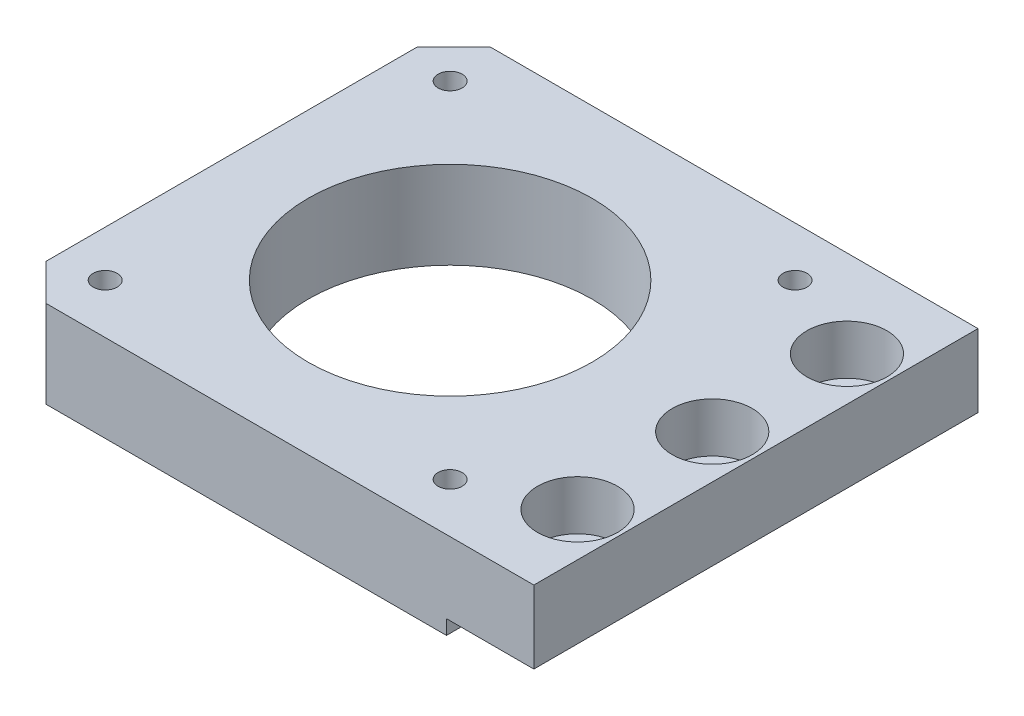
ISO-10303-21;
HEADER;
FILE_DESCRIPTION(('STEP AP214'),'2;1');
FILE_NAME('part.step','',(''),(''),'','','');
FILE_SCHEMA(('AUTOMOTIVE_DESIGN { 1 0 10303 214 1 1 1 1 }'));
ENDSEC;
DATA;
#1=APPLICATION_CONTEXT('core data for automotive mechanical design processes');
#2=APPLICATION_PROTOCOL_DEFINITION('international standard','automotive_design',2000,#1);
#3=PRODUCT_CONTEXT('',#1,'mechanical');
#4=PRODUCT('Part','Part','',(#3));
#5=PRODUCT_RELATED_PRODUCT_CATEGORY('part','',(#4));
#6=PRODUCT_DEFINITION_FORMATION('','',#4);
#7=PRODUCT_DEFINITION_CONTEXT('part definition',#1,'design');
#8=PRODUCT_DEFINITION('design','',#6,#7);
#9=PRODUCT_DEFINITION_SHAPE('','',#8);
#10=(LENGTH_UNIT() NAMED_UNIT(*) SI_UNIT(.MILLI.,.METRE.));
#11=(NAMED_UNIT(*) PLANE_ANGLE_UNIT() SI_UNIT($,.RADIAN.));
#12=(NAMED_UNIT(*) SI_UNIT($,.STERADIAN.) SOLID_ANGLE_UNIT());
#13=UNCERTAINTY_MEASURE_WITH_UNIT(LENGTH_MEASURE(1.E-05),#10,'distance_accuracy_value','');
#14=(GEOMETRIC_REPRESENTATION_CONTEXT(3) GLOBAL_UNCERTAINTY_ASSIGNED_CONTEXT((#13)) GLOBAL_UNIT_ASSIGNED_CONTEXT((#10,
#11,#12)) REPRESENTATION_CONTEXT('',''));
#15=CARTESIAN_POINT('',(0.,0.,0.));
#16=DIRECTION('',(0.,0.,1.));
#17=DIRECTION('',(1.,0.,0.));
#18=AXIS2_PLACEMENT_3D('',#15,#16,#17);
#19=CARTESIAN_POINT('',(-0.519371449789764,58.3620375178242,-61.));
#20=DIRECTION('',(0.,1.,0.));
#21=DIRECTION('',(-1.,0.,0.));
#22=AXIS2_PLACEMENT_3D('',#19,#20,#21);
#23=PLANE('',#22);
#24=CARTESIAN_POINT('',(-66.2074486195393,58.3620375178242,-6.81192283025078));
#25=DIRECTION('',(0.,-1.,0.));
#26=DIRECTION('',(0.,0.,-1.));
#27=AXIS2_PLACEMENT_3D('',#24,#25,#26);
#28=CIRCLE('',#27,1.65);
#29=CARTESIAN_POINT('',(-66.2074486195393,58.3620375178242,-8.46192283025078));
#30=VERTEX_POINT('',#29);
#31=EDGE_CURVE('E328',#30,#30,#28,.T.);
#32=ORIENTED_EDGE('',*,*,#31,.T.);
#33=EDGE_LOOP('',(#32));
#34=FACE_BOUND('',#33,.T.);
#35=CARTESIAN_POINT('',(-66.2074486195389,58.3620375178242,-54.1880771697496));
#36=DIRECTION('',(0.,-1.,0.));
#37=DIRECTION('',(0.,0.,-1.));
#38=AXIS2_PLACEMENT_3D('',#35,#36,#37);
#39=CIRCLE('',#38,1.65);
#40=CARTESIAN_POINT('',(-66.2074486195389,58.3620375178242,-55.8380771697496));
#41=VERTEX_POINT('',#40);
#42=EDGE_CURVE('E333',#41,#41,#39,.T.);
#43=ORIENTED_EDGE('',*,*,#42,.T.);
#44=EDGE_LOOP('',(#43));
#45=FACE_BOUND('',#44,.T.);
#46=CARTESIAN_POINT('',(-6.51937144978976,58.3620375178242,-49.));
#47=DIRECTION('',(0.,1.,0.));
#48=DIRECTION('',(0.,0.,1.));
#49=AXIS2_PLACEMENT_3D('',#46,#47,#48);
#50=CIRCLE('',#49,5.5);
#51=CARTESIAN_POINT('',(-6.51937144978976,58.3620375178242,-43.5));
#52=VERTEX_POINT('',#51);
#53=EDGE_CURVE('E336',#52,#52,#50,.T.);
#54=ORIENTED_EDGE('',*,*,#53,.F.);
#55=EDGE_LOOP('',(#54));
#56=FACE_BOUND('',#55,.T.);
#57=CARTESIAN_POINT('',(-6.51937144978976,58.3620375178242,-30.5));
#58=DIRECTION('',(0.,1.,0.));
#59=DIRECTION('',(0.,0.,1.));
#60=AXIS2_PLACEMENT_3D('',#57,#58,#59);
#61=CIRCLE('',#60,5.5);
#62=CARTESIAN_POINT('',(-6.51937144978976,58.3620375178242,-25.));
#63=VERTEX_POINT('',#62);
#64=EDGE_CURVE('E170',#63,#63,#61,.T.);
#65=ORIENTED_EDGE('',*,*,#64,.F.);
#66=EDGE_LOOP('',(#65));
#67=FACE_BOUND('',#66,.T.);
#68=CARTESIAN_POINT('',(-6.51937144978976,58.3620375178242,-12.));
#69=DIRECTION('',(0.,1.,0.));
#70=DIRECTION('',(0.,0.,1.));
#71=AXIS2_PLACEMENT_3D('',#68,#69,#70);
#72=CIRCLE('',#71,5.5);
#73=CARTESIAN_POINT('',(-6.51937144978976,58.3620375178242,-6.5));
#74=VERTEX_POINT('',#73);
#75=EDGE_CURVE('E157',#74,#74,#72,.T.);
#76=ORIENTED_EDGE('',*,*,#75,.F.);
#77=EDGE_LOOP('',(#76));
#78=FACE_BOUND('',#77,.T.);
#79=CARTESIAN_POINT('',(-42.5193714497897,58.3620375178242,-30.5));
#80=DIRECTION('',(0.,-1.,0.));
#81=DIRECTION('',(1.,0.,0.));
#82=AXIS2_PLACEMENT_3D('',#79,#80,#81);
#83=CIRCLE('',#82,19.5);
#84=CARTESIAN_POINT('',(-23.0193714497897,58.3620375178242,-30.5));
#85=VERTEX_POINT('',#84);
#86=EDGE_CURVE('E120',#85,#85,#83,.T.);
#87=ORIENTED_EDGE('',*,*,#86,.T.);
#88=EDGE_LOOP('',(#87));
#89=FACE_BOUND('',#88,.T.);
#90=DIRECTION('',(0.,0.,1.));
#91=VECTOR('',#90,1.);
#92=CARTESIAN_POINT('',(-72.5193714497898,58.3620375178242,-61.));
#93=LINE('',#92,#91);
#94=CARTESIAN_POINT('',(-72.5193714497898,58.3620375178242,-56.));
#95=VERTEX_POINT('',#94);
#96=CARTESIAN_POINT('',(-72.5193714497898,58.3620375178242,-5.));
#97=VERTEX_POINT('',#96);
#98=EDGE_CURVE('E130',#95,#97,#93,.T.);
#99=ORIENTED_EDGE('',*,*,#98,.T.);
#100=DIRECTION('',(-0.707106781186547,0.,-0.707106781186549));
#101=VECTOR('',#100,1.);
#102=CARTESIAN_POINT('',(-64.5193714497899,58.3620375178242,2.9999999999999));
#103=LINE('',#102,#101);
#104=CARTESIAN_POINT('',(-67.5193714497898,58.3620375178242,0.));
#105=VERTEX_POINT('',#104);
#106=EDGE_CURVE('E25',#97,#105,#103,.F.);
#107=ORIENTED_EDGE('',*,*,#106,.T.);
#108=DIRECTION('',(-1.,0.,0.));
#109=VECTOR('',#108,1.);
#110=CARTESIAN_POINT('',(-0.519371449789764,58.3620375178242,0.));
#111=LINE('',#110,#109);
#112=CARTESIAN_POINT('',(-0.519371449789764,58.3620375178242,0.));
#113=VERTEX_POINT('',#112);
#114=EDGE_CURVE('E94',#113,#105,#111,.T.);
#115=ORIENTED_EDGE('',*,*,#114,.F.);
#116=DIRECTION('',(0.,0.,1.));
#117=VECTOR('',#116,1.);
#118=CARTESIAN_POINT('',(-0.519371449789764,58.3620375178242,-61.));
#119=LINE('',#118,#117);
#120=CARTESIAN_POINT('',(-0.519371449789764,58.3620375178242,-61.));
#121=VERTEX_POINT('',#120);
#122=EDGE_CURVE('E133',#121,#113,#119,.T.);
#123=ORIENTED_EDGE('',*,*,#122,.F.);
#124=DIRECTION('',(-1.,0.,0.));
#125=VECTOR('',#124,1.);
#126=CARTESIAN_POINT('',(-0.519371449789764,58.3620375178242,-61.));
#127=LINE('',#126,#125);
#128=CARTESIAN_POINT('',(-67.5193714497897,58.3620375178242,-61.));
#129=VERTEX_POINT('',#128);
#130=EDGE_CURVE('E116',#121,#129,#127,.T.);
#131=ORIENTED_EDGE('',*,*,#130,.T.);
#132=DIRECTION('',(-0.707106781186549,0.,0.707106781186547));
#133=VECTOR('',#132,1.);
#134=CARTESIAN_POINT('',(-34.0193714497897,58.3620375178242,-94.5));
#135=LINE('',#134,#133);
#136=EDGE_CURVE('E148',#129,#95,#135,.T.);
#137=ORIENTED_EDGE('',*,*,#136,.T.);
#138=EDGE_LOOP('',(#99,#107,#115,#123,#131,#137));
#139=FACE_BOUND('',#138,.T.);
#140=CARTESIAN_POINT('',(-18.8312942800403,58.3620375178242,-54.1880771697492));
#141=DIRECTION('',(0.,-1.,0.));
#142=DIRECTION('',(0.,0.,-1.));
#143=AXIS2_PLACEMENT_3D('',#140,#141,#142);
#144=CIRCLE('',#143,1.65);
#145=CARTESIAN_POINT('',(-18.8312942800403,58.3620375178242,-55.8380771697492));
#146=VERTEX_POINT('',#145);
#147=EDGE_CURVE('E322',#146,#146,#144,.T.);
#148=ORIENTED_EDGE('',*,*,#147,.T.);
#149=EDGE_LOOP('',(#148));
#150=FACE_BOUND('',#149,.T.);
#151=CARTESIAN_POINT('',(-18.8312942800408,58.3620375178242,-6.8119228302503));
#152=DIRECTION('',(0.,-1.,0.));
#153=DIRECTION('',(0.,0.,-1.));
#154=AXIS2_PLACEMENT_3D('',#151,#152,#153);
#155=CIRCLE('',#154,1.65);
#156=CARTESIAN_POINT('',(-18.8312942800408,58.3620375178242,-8.4619228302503));
#157=VERTEX_POINT('',#156);
#158=EDGE_CURVE('E313',#157,#157,#155,.T.);
#159=ORIENTED_EDGE('',*,*,#158,.T.);
#160=EDGE_LOOP('',(#159));
#161=FACE_BOUND('',#160,.T.);
#162=ADVANCED_FACE('F16',(#34,#45,#56,#67,#78,#89,#139,#150,#161),#23,.T.);
#163=CARTESIAN_POINT('',(-72.5193714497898,46.3620375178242,-61.));
#164=DIRECTION('',(-1.,0.,0.));
#165=DIRECTION('',(0.,0.,1.));
#166=AXIS2_PLACEMENT_3D('',#163,#164,#165);
#167=PLANE('',#166);
#168=DIRECTION('',(0.,0.,1.));
#169=VECTOR('',#168,1.);
#170=CARTESIAN_POINT('',(-72.5193714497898,46.3620375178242,-61.));
#171=LINE('',#170,#169);
#172=CARTESIAN_POINT('',(-72.5193714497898,46.3620375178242,-56.));
#173=VERTEX_POINT('',#172);
#174=CARTESIAN_POINT('',(-72.5193714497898,46.3620375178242,-5.));
#175=VERTEX_POINT('',#174);
#176=EDGE_CURVE('E102',#173,#175,#171,.T.);
#177=ORIENTED_EDGE('',*,*,#176,.T.);
#178=DIRECTION('',(0.,1.,0.));
#179=VECTOR('',#178,1.);
#180=CARTESIAN_POINT('',(-72.5193714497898,46.3620375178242,-5.));
#181=LINE('',#180,#179);
#182=EDGE_CURVE('E39',#175,#97,#181,.T.);
#183=ORIENTED_EDGE('',*,*,#182,.T.);
#184=ORIENTED_EDGE('',*,*,#98,.F.);
#185=DIRECTION('',(0.,-1.,0.));
#186=VECTOR('',#185,1.);
#187=CARTESIAN_POINT('',(-72.5193714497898,46.3620375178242,-56.));
#188=LINE('',#187,#186);
#189=EDGE_CURVE('E144',#95,#173,#188,.T.);
#190=ORIENTED_EDGE('',*,*,#189,.T.);
#191=EDGE_LOOP('',(#177,#183,#184,#190));
#192=FACE_BOUND('',#191,.T.);
#193=ADVANCED_FACE('F201',(#192),#167,.T.);
#194=CARTESIAN_POINT('',(-0.519371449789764,48.3620375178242,-61.));
#195=DIRECTION('',(1.,0.,0.));
#196=DIRECTION('',(0.,0.,-1.));
#197=AXIS2_PLACEMENT_3D('',#194,#195,#196);
#198=PLANE('',#197);
#199=DIRECTION('',(0.,1.,0.));
#200=VECTOR('',#199,1.);
#201=CARTESIAN_POINT('',(-0.519371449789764,48.3620375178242,0.));
#202=LINE('',#201,#200);
#203=CARTESIAN_POINT('',(-0.519371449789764,48.3620375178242,0.));
#204=VERTEX_POINT('',#203);
#205=EDGE_CURVE('E125',#204,#113,#202,.T.);
#206=ORIENTED_EDGE('',*,*,#205,.F.);
#207=DIRECTION('',(0.,0.,1.));
#208=VECTOR('',#207,1.);
#209=CARTESIAN_POINT('',(-0.519371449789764,48.3620375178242,-61.));
#210=LINE('',#209,#208);
#211=CARTESIAN_POINT('',(-0.519371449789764,48.3620375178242,-61.));
#212=VERTEX_POINT('',#211);
#213=EDGE_CURVE('E135',#212,#204,#210,.T.);
#214=ORIENTED_EDGE('',*,*,#213,.F.);
#215=DIRECTION('',(0.,1.,0.));
#216=VECTOR('',#215,1.);
#217=CARTESIAN_POINT('',(-0.519371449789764,48.3620375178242,-61.));
#218=LINE('',#217,#216);
#219=EDGE_CURVE('E110',#212,#121,#218,.T.);
#220=ORIENTED_EDGE('',*,*,#219,.T.);
#221=ORIENTED_EDGE('',*,*,#122,.T.);
#222=EDGE_LOOP('',(#206,#214,#220,#221));
#223=FACE_BOUND('',#222,.T.);
#224=ADVANCED_FACE('F208',(#223),#198,.T.);
#225=CARTESIAN_POINT('',(-0.519371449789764,48.3620375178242,-61.));
#226=DIRECTION('',(0.,-1.,0.));
#227=DIRECTION('',(0.,0.,-1.));
#228=AXIS2_PLACEMENT_3D('',#225,#226,#227);
#229=PLANE('',#228);
#230=CARTESIAN_POINT('',(-6.51937144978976,48.3620375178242,-49.));
#231=DIRECTION('',(0.,-1.,0.));
#232=DIRECTION('',(0.,0.,-1.));
#233=AXIS2_PLACEMENT_3D('',#230,#231,#232);
#234=CIRCLE('',#233,3.3);
#235=CARTESIAN_POINT('',(-6.51937144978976,48.3620375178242,-52.3));
#236=VERTEX_POINT('',#235);
#237=EDGE_CURVE('E20',#236,#236,#234,.T.);
#238=ORIENTED_EDGE('',*,*,#237,.F.);
#239=EDGE_LOOP('',(#238));
#240=FACE_BOUND('',#239,.T.);
#241=CARTESIAN_POINT('',(-6.51937144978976,48.3620375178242,-30.5));
#242=DIRECTION('',(0.,-1.,0.));
#243=DIRECTION('',(0.,0.,-1.));
#244=AXIS2_PLACEMENT_3D('',#241,#242,#243);
#245=CIRCLE('',#244,3.3);
#246=CARTESIAN_POINT('',(-6.51937144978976,48.3620375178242,-33.8));
#247=VERTEX_POINT('',#246);
#248=EDGE_CURVE('E155',#247,#247,#245,.T.);
#249=ORIENTED_EDGE('',*,*,#248,.F.);
#250=EDGE_LOOP('',(#249));
#251=FACE_BOUND('',#250,.T.);
#252=CARTESIAN_POINT('',(-6.51937144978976,48.3620375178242,-12.));
#253=DIRECTION('',(0.,-1.,0.));
#254=DIRECTION('',(0.,0.,-1.));
#255=AXIS2_PLACEMENT_3D('',#252,#253,#254);
#256=CIRCLE('',#255,3.3);
#257=CARTESIAN_POINT('',(-6.51937144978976,48.3620375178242,-15.3));
#258=VERTEX_POINT('',#257);
#259=EDGE_CURVE('E151',#258,#258,#256,.T.);
#260=ORIENTED_EDGE('',*,*,#259,.F.);
#261=EDGE_LOOP('',(#260));
#262=FACE_BOUND('',#261,.T.);
#263=DIRECTION('',(1.,0.,0.));
#264=VECTOR('',#263,1.);
#265=CARTESIAN_POINT('',(-0.519371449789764,48.3620375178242,0.));
#266=LINE('',#265,#264);
#267=CARTESIAN_POINT('',(-12.5193714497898,48.3620375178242,0.));
#268=VERTEX_POINT('',#267);
#269=EDGE_CURVE('E122',#268,#204,#266,.T.);
#270=ORIENTED_EDGE('',*,*,#269,.F.);
#271=DIRECTION('',(0.,0.,1.));
#272=VECTOR('',#271,1.);
#273=CARTESIAN_POINT('',(-12.5193714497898,48.3620375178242,-61.));
#274=LINE('',#273,#272);
#275=CARTESIAN_POINT('',(-12.5193714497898,48.3620375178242,-61.));
#276=VERTEX_POINT('',#275);
#277=EDGE_CURVE('E101',#276,#268,#274,.T.);
#278=ORIENTED_EDGE('',*,*,#277,.F.);
#279=DIRECTION('',(1.,0.,0.));
#280=VECTOR('',#279,1.);
#281=CARTESIAN_POINT('',(-0.519371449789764,48.3620375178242,-61.));
#282=LINE('',#281,#280);
#283=EDGE_CURVE('E108',#276,#212,#282,.T.);
#284=ORIENTED_EDGE('',*,*,#283,.T.);
#285=ORIENTED_EDGE('',*,*,#213,.T.);
#286=EDGE_LOOP('',(#270,#278,#284,#285));
#287=FACE_BOUND('',#286,.T.);
#288=ADVANCED_FACE('F195',(#240,#251,#262,#287),#229,.T.);
#289=CARTESIAN_POINT('',(-12.5193714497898,46.3620375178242,-61.));
#290=DIRECTION('',(1.,0.,0.));
#291=DIRECTION('',(0.,0.,-1.));
#292=AXIS2_PLACEMENT_3D('',#289,#290,#291);
#293=PLANE('',#292);
#294=DIRECTION('',(0.,1.,0.));
#295=VECTOR('',#294,1.);
#296=CARTESIAN_POINT('',(-12.5193714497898,46.3620375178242,0.));
#297=LINE('',#296,#295);
#298=CARTESIAN_POINT('',(-12.5193714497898,46.3620375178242,0.));
#299=VERTEX_POINT('',#298);
#300=EDGE_CURVE('E100',#299,#268,#297,.T.);
#301=ORIENTED_EDGE('',*,*,#300,.F.);
#302=DIRECTION('',(0.,0.,1.));
#303=VECTOR('',#302,1.);
#304=CARTESIAN_POINT('',(-12.5193714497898,46.3620375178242,-61.));
#305=LINE('',#304,#303);
#306=CARTESIAN_POINT('',(-12.5193714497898,46.3620375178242,-61.));
#307=VERTEX_POINT('',#306);
#308=EDGE_CURVE('E88',#307,#299,#305,.T.);
#309=ORIENTED_EDGE('',*,*,#308,.F.);
#310=DIRECTION('',(0.,1.,0.));
#311=VECTOR('',#310,1.);
#312=CARTESIAN_POINT('',(-12.5193714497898,46.3620375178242,-61.));
#313=LINE('',#312,#311);
#314=EDGE_CURVE('E93',#307,#276,#313,.T.);
#315=ORIENTED_EDGE('',*,*,#314,.T.);
#316=ORIENTED_EDGE('',*,*,#277,.T.);
#317=EDGE_LOOP('',(#301,#309,#315,#316));
#318=FACE_BOUND('',#317,.T.);
#319=ADVANCED_FACE('F98',(#318),#293,.T.);
#320=CARTESIAN_POINT('',(-12.5193714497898,46.3620375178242,-61.));
#321=DIRECTION('',(0.,-1.,0.));
#322=DIRECTION('',(1.,0.,0.));
#323=AXIS2_PLACEMENT_3D('',#320,#321,#322);
#324=PLANE('',#323);
#325=CARTESIAN_POINT('',(-18.8312942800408,46.3620375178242,-6.8119228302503));
#326=DIRECTION('',(0.,-1.,0.));
#327=DIRECTION('',(0.,0.,-1.));
#328=AXIS2_PLACEMENT_3D('',#325,#326,#327);
#329=CIRCLE('',#328,1.65);
#330=CARTESIAN_POINT('',(-18.8312942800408,46.3620375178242,-8.4619228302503));
#331=VERTEX_POINT('',#330);
#332=EDGE_CURVE('E315',#331,#331,#329,.T.);
#333=ORIENTED_EDGE('',*,*,#332,.F.);
#334=EDGE_LOOP('',(#333));
#335=FACE_BOUND('',#334,.T.);
#336=CARTESIAN_POINT('',(-18.8312942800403,46.3620375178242,-54.1880771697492));
#337=DIRECTION('',(0.,-1.,0.));
#338=DIRECTION('',(0.,0.,-1.));
#339=AXIS2_PLACEMENT_3D('',#336,#337,#338);
#340=CIRCLE('',#339,1.65);
#341=CARTESIAN_POINT('',(-18.8312942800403,46.3620375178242,-55.8380771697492));
#342=VERTEX_POINT('',#341);
#343=EDGE_CURVE('E317',#342,#342,#340,.T.);
#344=ORIENTED_EDGE('',*,*,#343,.F.);
#345=EDGE_LOOP('',(#344));
#346=FACE_BOUND('',#345,.T.);
#347=CARTESIAN_POINT('',(-66.2074486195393,46.3620375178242,-6.81192283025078));
#348=DIRECTION('',(0.,-1.,0.));
#349=DIRECTION('',(0.,0.,-1.));
#350=AXIS2_PLACEMENT_3D('',#347,#348,#349);
#351=CIRCLE('',#350,1.65);
#352=CARTESIAN_POINT('',(-66.2074486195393,46.3620375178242,-8.46192283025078));
#353=VERTEX_POINT('',#352);
#354=EDGE_CURVE('E325',#353,#353,#351,.T.);
#355=ORIENTED_EDGE('',*,*,#354,.F.);
#356=EDGE_LOOP('',(#355));
#357=FACE_BOUND('',#356,.T.);
#358=CARTESIAN_POINT('',(-66.2074486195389,46.3620375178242,-54.1880771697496));
#359=DIRECTION('',(0.,-1.,0.));
#360=DIRECTION('',(0.,0.,-1.));
#361=AXIS2_PLACEMENT_3D('',#358,#359,#360);
#362=CIRCLE('',#361,1.65);
#363=CARTESIAN_POINT('',(-66.2074486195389,46.3620375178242,-55.8380771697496));
#364=VERTEX_POINT('',#363);
#365=EDGE_CURVE('E330',#364,#364,#362,.T.);
#366=ORIENTED_EDGE('',*,*,#365,.F.);
#367=EDGE_LOOP('',(#366));
#368=FACE_BOUND('',#367,.T.);
#369=CARTESIAN_POINT('',(-42.5193714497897,46.3620375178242,-30.5));
#370=DIRECTION('',(0.,-1.,0.));
#371=DIRECTION('',(1.,0.,0.));
#372=AXIS2_PLACEMENT_3D('',#369,#370,#371);
#373=CIRCLE('',#372,19.5);
#374=CARTESIAN_POINT('',(-23.0193714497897,46.3620375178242,-30.5));
#375=VERTEX_POINT('',#374);
#376=EDGE_CURVE('E153',#375,#375,#373,.T.);
#377=ORIENTED_EDGE('',*,*,#376,.F.);
#378=EDGE_LOOP('',(#377));
#379=FACE_BOUND('',#378,.T.);
#380=DIRECTION('',(1.,0.,0.));
#381=VECTOR('',#380,1.);
#382=CARTESIAN_POINT('',(-12.5193714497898,46.3620375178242,0.));
#383=LINE('',#382,#381);
#384=CARTESIAN_POINT('',(-67.5193714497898,46.3620375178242,0.));
#385=VERTEX_POINT('',#384);
#386=EDGE_CURVE('E118',#385,#299,#383,.T.);
#387=ORIENTED_EDGE('',*,*,#386,.F.);
#388=DIRECTION('',(0.707106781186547,0.,0.707106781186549));
#389=VECTOR('',#388,1.);
#390=CARTESIAN_POINT('',(-70.5193714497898,46.3620375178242,-3.0000000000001));
#391=LINE('',#390,#389);
#392=EDGE_CURVE('E142',#385,#175,#391,.F.);
#393=ORIENTED_EDGE('',*,*,#392,.T.);
#394=ORIENTED_EDGE('',*,*,#176,.F.);
#395=DIRECTION('',(0.707106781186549,0.,-0.707106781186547));
#396=VECTOR('',#395,1.);
#397=CARTESIAN_POINT('',(-40.0193714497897,46.3620375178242,-88.5));
#398=LINE('',#397,#396);
#399=CARTESIAN_POINT('',(-67.5193714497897,46.3620375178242,-61.));
#400=VERTEX_POINT('',#399);
#401=EDGE_CURVE('E91',#173,#400,#398,.T.);
#402=ORIENTED_EDGE('',*,*,#401,.T.);
#403=DIRECTION('',(1.,0.,0.));
#404=VECTOR('',#403,1.);
#405=CARTESIAN_POINT('',(-12.5193714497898,46.3620375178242,-61.));
#406=LINE('',#405,#404);
#407=EDGE_CURVE('E84',#400,#307,#406,.T.);
#408=ORIENTED_EDGE('',*,*,#407,.T.);
#409=ORIENTED_EDGE('',*,*,#308,.T.);
#410=EDGE_LOOP('',(#387,#393,#394,#402,#408,#409));
#411=FACE_BOUND('',#410,.T.);
#412=ADVANCED_FACE('F87',(#335,#346,#357,#368,#379,#411),#324,.T.);
#413=CARTESIAN_POINT('',(0.,0.,-61.));
#414=DIRECTION('',(0.,0.,1.));
#415=DIRECTION('',(1.,0.,0.));
#416=AXIS2_PLACEMENT_3D('',#413,#414,#415);
#417=PLANE('',#416);
#418=ORIENTED_EDGE('',*,*,#407,.F.);
#419=DIRECTION('',(0.,1.,0.));
#420=VECTOR('',#419,1.);
#421=CARTESIAN_POINT('',(-67.5193714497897,58.3620375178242,-61.));
#422=LINE('',#421,#420);
#423=EDGE_CURVE('E11',#400,#129,#422,.T.);
#424=ORIENTED_EDGE('',*,*,#423,.T.);
#425=ORIENTED_EDGE('',*,*,#130,.F.);
#426=ORIENTED_EDGE('',*,*,#219,.F.);
#427=ORIENTED_EDGE('',*,*,#283,.F.);
#428=ORIENTED_EDGE('',*,*,#314,.F.);
#429=EDGE_LOOP('',(#418,#424,#425,#426,#427,#428));
#430=FACE_BOUND('',#429,.T.);
#431=ADVANCED_FACE('F105',(#430),#417,.F.);
#432=CARTESIAN_POINT('',(0.,0.,0.));
#433=DIRECTION('',(0.,0.,1.));
#434=DIRECTION('',(1.,0.,0.));
#435=AXIS2_PLACEMENT_3D('',#432,#433,#434);
#436=PLANE('',#435);
#437=ORIENTED_EDGE('',*,*,#114,.T.);
#438=DIRECTION('',(0.,-1.,0.));
#439=VECTOR('',#438,1.);
#440=CARTESIAN_POINT('',(-67.5193714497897,0.,0.));
#441=LINE('',#440,#439);
#442=EDGE_CURVE('E132',#105,#385,#441,.T.);
#443=ORIENTED_EDGE('',*,*,#442,.T.);
#444=ORIENTED_EDGE('',*,*,#386,.T.);
#445=ORIENTED_EDGE('',*,*,#300,.T.);
#446=ORIENTED_EDGE('',*,*,#269,.T.);
#447=ORIENTED_EDGE('',*,*,#205,.T.);
#448=EDGE_LOOP('',(#437,#443,#444,#445,#446,#447));
#449=FACE_BOUND('',#448,.T.);
#450=ADVANCED_FACE('F193',(#449),#436,.T.);
#451=CARTESIAN_POINT('',(-42.5193714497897,58.3620375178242,-30.5));
#452=DIRECTION('',(0.,-1.,0.));
#453=DIRECTION('',(1.,0.,0.));
#454=AXIS2_PLACEMENT_3D('',#451,#452,#453);
#455=CYLINDRICAL_SURFACE('',#454,19.5);
#456=ORIENTED_EDGE('',*,*,#86,.F.);
#457=EDGE_LOOP('',(#456));
#458=FACE_BOUND('',#457,.T.);
#459=ORIENTED_EDGE('',*,*,#376,.T.);
#460=EDGE_LOOP('',(#459));
#461=FACE_BOUND('',#460,.T.);
#462=ADVANCED_FACE('F182',(#458,#461),#455,.F.);
#463=CARTESIAN_POINT('',(-67.5193714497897,0.,0.));
#464=DIRECTION('',(0.707106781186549,0.,-0.707106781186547));
#465=DIRECTION('',(0.,-1.,0.));
#466=AXIS2_PLACEMENT_3D('',#463,#464,#465);
#467=PLANE('',#466);
#468=ORIENTED_EDGE('',*,*,#106,.F.);
#469=ORIENTED_EDGE('',*,*,#182,.F.);
#470=ORIENTED_EDGE('',*,*,#392,.F.);
#471=ORIENTED_EDGE('',*,*,#442,.F.);
#472=EDGE_LOOP('',(#468,#469,#470,#471));
#473=FACE_BOUND('',#472,.T.);
#474=ADVANCED_FACE('F234',(#473),#467,.F.);
#475=CARTESIAN_POINT('',(-72.5193714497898,46.3620375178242,-56.));
#476=DIRECTION('',(-0.707106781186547,0.,-0.707106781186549));
#477=DIRECTION('',(0.,1.,0.));
#478=AXIS2_PLACEMENT_3D('',#475,#476,#477);
#479=PLANE('',#478);
#480=ORIENTED_EDGE('',*,*,#136,.F.);
#481=ORIENTED_EDGE('',*,*,#423,.F.);
#482=ORIENTED_EDGE('',*,*,#401,.F.);
#483=ORIENTED_EDGE('',*,*,#189,.F.);
#484=EDGE_LOOP('',(#480,#481,#482,#483));
#485=FACE_BOUND('',#484,.T.);
#486=ADVANCED_FACE('F18',(#485),#479,.T.);
#487=CARTESIAN_POINT('',(-6.51937144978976,58.3620375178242,-12.));
#488=DIRECTION('',(0.,1.,0.));
#489=DIRECTION('',(0.,0.,1.));
#490=AXIS2_PLACEMENT_3D('',#487,#488,#489);
#491=CYLINDRICAL_SURFACE('',#490,3.3);
#492=ORIENTED_EDGE('',*,*,#259,.T.);
#493=EDGE_LOOP('',(#492));
#494=FACE_BOUND('',#493,.T.);
#495=CARTESIAN_POINT('',(-6.51937144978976,51.5620375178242,-12.));
#496=DIRECTION('',(0.,1.,0.));
#497=DIRECTION('',(0.,0.,1.));
#498=AXIS2_PLACEMENT_3D('',#495,#496,#497);
#499=CIRCLE('',#498,3.3);
#500=CARTESIAN_POINT('',(-6.51937144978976,51.5620375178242,-8.7));
#501=VERTEX_POINT('',#500);
#502=EDGE_CURVE('E154',#501,#501,#499,.T.);
#503=ORIENTED_EDGE('',*,*,#502,.T.);
#504=EDGE_LOOP('',(#503));
#505=FACE_BOUND('',#504,.T.);
#506=ADVANCED_FACE('F241',(#494,#505),#491,.F.);
#507=CARTESIAN_POINT('',(-3.21937144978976,51.5620375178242,-12.));
#508=DIRECTION('',(0.,-1.,0.));
#509=DIRECTION('',(0.,0.,-1.));
#510=AXIS2_PLACEMENT_3D('',#507,#508,#509);
#511=PLANE('',#510);
#512=ORIENTED_EDGE('',*,*,#502,.F.);
#513=EDGE_LOOP('',(#512));
#514=FACE_BOUND('',#513,.T.);
#515=CARTESIAN_POINT('',(-6.51937144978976,51.5620375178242,-12.));
#516=DIRECTION('',(0.,1.,0.));
#517=DIRECTION('',(0.,0.,1.));
#518=AXIS2_PLACEMENT_3D('',#515,#516,#517);
#519=CIRCLE('',#518,5.5);
#520=CARTESIAN_POINT('',(-6.51937144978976,51.5620375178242,-6.5));
#521=VERTEX_POINT('',#520);
#522=EDGE_CURVE('E162',#521,#521,#519,.T.);
#523=ORIENTED_EDGE('',*,*,#522,.T.);
#524=EDGE_LOOP('',(#523));
#525=FACE_BOUND('',#524,.T.);
#526=ADVANCED_FACE('F247',(#514,#525),#511,.F.);
#527=CARTESIAN_POINT('',(-6.51937144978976,58.3620375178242,-12.));
#528=DIRECTION('',(0.,1.,0.));
#529=DIRECTION('',(0.,0.,1.));
#530=AXIS2_PLACEMENT_3D('',#527,#528,#529);
#531=CYLINDRICAL_SURFACE('',#530,5.5);
#532=ORIENTED_EDGE('',*,*,#522,.F.);
#533=EDGE_LOOP('',(#532));
#534=FACE_BOUND('',#533,.T.);
#535=ORIENTED_EDGE('',*,*,#75,.T.);
#536=EDGE_LOOP('',(#535));
#537=FACE_BOUND('',#536,.T.);
#538=ADVANCED_FACE('F264',(#534,#537),#531,.F.);
#539=CARTESIAN_POINT('',(-6.51937144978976,58.3620375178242,-30.5));
#540=DIRECTION('',(0.,1.,0.));
#541=DIRECTION('',(0.,0.,1.));
#542=AXIS2_PLACEMENT_3D('',#539,#540,#541);
#543=CYLINDRICAL_SURFACE('',#542,3.3);
#544=ORIENTED_EDGE('',*,*,#248,.T.);
#545=EDGE_LOOP('',(#544));
#546=FACE_BOUND('',#545,.T.);
#547=CARTESIAN_POINT('',(-6.51937144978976,51.5620375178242,-30.5));
#548=DIRECTION('',(0.,1.,0.));
#549=DIRECTION('',(0.,0.,1.));
#550=AXIS2_PLACEMENT_3D('',#547,#548,#549);
#551=CIRCLE('',#550,3.3);
#552=CARTESIAN_POINT('',(-6.51937144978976,51.5620375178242,-27.2));
#553=VERTEX_POINT('',#552);
#554=EDGE_CURVE('E158',#553,#553,#551,.T.);
#555=ORIENTED_EDGE('',*,*,#554,.T.);
#556=EDGE_LOOP('',(#555));
#557=FACE_BOUND('',#556,.T.);
#558=ADVANCED_FACE('F268',(#546,#557),#543,.F.);
#559=CARTESIAN_POINT('',(-3.21937144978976,51.5620375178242,-30.5));
#560=DIRECTION('',(0.,-1.,0.));
#561=DIRECTION('',(0.,0.,-1.));
#562=AXIS2_PLACEMENT_3D('',#559,#560,#561);
#563=PLANE('',#562);
#564=ORIENTED_EDGE('',*,*,#554,.F.);
#565=EDGE_LOOP('',(#564));
#566=FACE_BOUND('',#565,.T.);
#567=CARTESIAN_POINT('',(-6.51937144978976,51.5620375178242,-30.5));
#568=DIRECTION('',(0.,1.,0.));
#569=DIRECTION('',(0.,0.,1.));
#570=AXIS2_PLACEMENT_3D('',#567,#568,#569);
#571=CIRCLE('',#570,5.5);
#572=CARTESIAN_POINT('',(-6.51937144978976,51.5620375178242,-25.));
#573=VERTEX_POINT('',#572);
#574=EDGE_CURVE('E165',#573,#573,#571,.T.);
#575=ORIENTED_EDGE('',*,*,#574,.T.);
#576=EDGE_LOOP('',(#575));
#577=FACE_BOUND('',#576,.T.);
#578=ADVANCED_FACE('F272',(#566,#577),#563,.F.);
#579=CARTESIAN_POINT('',(-6.51937144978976,58.3620375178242,-30.5));
#580=DIRECTION('',(0.,1.,0.));
#581=DIRECTION('',(0.,0.,1.));
#582=AXIS2_PLACEMENT_3D('',#579,#580,#581);
#583=CYLINDRICAL_SURFACE('',#582,5.5);
#584=ORIENTED_EDGE('',*,*,#574,.F.);
#585=EDGE_LOOP('',(#584));
#586=FACE_BOUND('',#585,.T.);
#587=ORIENTED_EDGE('',*,*,#64,.T.);
#588=EDGE_LOOP('',(#587));
#589=FACE_BOUND('',#588,.T.);
#590=ADVANCED_FACE('F275',(#586,#589),#583,.F.);
#591=CARTESIAN_POINT('',(-6.51937144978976,58.3620375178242,-49.));
#592=DIRECTION('',(0.,1.,0.));
#593=DIRECTION('',(0.,0.,1.));
#594=AXIS2_PLACEMENT_3D('',#591,#592,#593);
#595=CYLINDRICAL_SURFACE('',#594,3.3);
#596=ORIENTED_EDGE('',*,*,#237,.T.);
#597=EDGE_LOOP('',(#596));
#598=FACE_BOUND('',#597,.T.);
#599=CARTESIAN_POINT('',(-6.51937144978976,51.5620375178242,-49.));
#600=DIRECTION('',(0.,1.,0.));
#601=DIRECTION('',(0.,0.,1.));
#602=AXIS2_PLACEMENT_3D('',#599,#600,#601);
#603=CIRCLE('',#602,3.3);
#604=CARTESIAN_POINT('',(-6.51937144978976,51.5620375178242,-45.7));
#605=VERTEX_POINT('',#604);
#606=EDGE_CURVE('E342',#605,#605,#603,.T.);
#607=ORIENTED_EDGE('',*,*,#606,.T.);
#608=EDGE_LOOP('',(#607));
#609=FACE_BOUND('',#608,.T.);
#610=ADVANCED_FACE('F279',(#598,#609),#595,.F.);
#611=CARTESIAN_POINT('',(-3.21937144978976,51.5620375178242,-49.));
#612=DIRECTION('',(0.,-1.,0.));
#613=DIRECTION('',(0.,0.,-1.));
#614=AXIS2_PLACEMENT_3D('',#611,#612,#613);
#615=PLANE('',#614);
#616=ORIENTED_EDGE('',*,*,#606,.F.);
#617=EDGE_LOOP('',(#616));
#618=FACE_BOUND('',#617,.T.);
#619=CARTESIAN_POINT('',(-6.51937144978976,51.5620375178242,-49.));
#620=DIRECTION('',(0.,1.,0.));
#621=DIRECTION('',(0.,0.,1.));
#622=AXIS2_PLACEMENT_3D('',#619,#620,#621);
#623=CIRCLE('',#622,5.5);
#624=CARTESIAN_POINT('',(-6.51937144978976,51.5620375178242,-43.5));
#625=VERTEX_POINT('',#624);
#626=EDGE_CURVE('E339',#625,#625,#623,.T.);
#627=ORIENTED_EDGE('',*,*,#626,.T.);
#628=EDGE_LOOP('',(#627));
#629=FACE_BOUND('',#628,.T.);
#630=ADVANCED_FACE('F283',(#618,#629),#615,.F.);
#631=CARTESIAN_POINT('',(-6.51937144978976,58.3620375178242,-49.));
#632=DIRECTION('',(0.,1.,0.));
#633=DIRECTION('',(0.,0.,1.));
#634=AXIS2_PLACEMENT_3D('',#631,#632,#633);
#635=CYLINDRICAL_SURFACE('',#634,5.5);
#636=ORIENTED_EDGE('',*,*,#626,.F.);
#637=EDGE_LOOP('',(#636));
#638=FACE_BOUND('',#637,.T.);
#639=ORIENTED_EDGE('',*,*,#53,.T.);
#640=EDGE_LOOP('',(#639));
#641=FACE_BOUND('',#640,.T.);
#642=ADVANCED_FACE('F287',(#638,#641),#635,.F.);
#643=CARTESIAN_POINT('',(-66.2074486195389,46.3620375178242,-54.1880771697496));
#644=DIRECTION('',(0.,-1.,0.));
#645=DIRECTION('',(0.,0.,-1.));
#646=AXIS2_PLACEMENT_3D('',#643,#644,#645);
#647=CYLINDRICAL_SURFACE('',#646,1.65);
#648=ORIENTED_EDGE('',*,*,#42,.F.);
#649=EDGE_LOOP('',(#648));
#650=FACE_BOUND('',#649,.T.);
#651=ORIENTED_EDGE('',*,*,#365,.T.);
#652=EDGE_LOOP('',(#651));
#653=FACE_BOUND('',#652,.T.);
#654=ADVANCED_FACE('F291',(#650,#653),#647,.F.);
#655=CARTESIAN_POINT('',(-66.2074486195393,46.3620375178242,-6.81192283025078));
#656=DIRECTION('',(0.,-1.,0.));
#657=DIRECTION('',(0.,0.,-1.));
#658=AXIS2_PLACEMENT_3D('',#655,#656,#657);
#659=CYLINDRICAL_SURFACE('',#658,1.65);
#660=ORIENTED_EDGE('',*,*,#31,.F.);
#661=EDGE_LOOP('',(#660));
#662=FACE_BOUND('',#661,.T.);
#663=ORIENTED_EDGE('',*,*,#354,.T.);
#664=EDGE_LOOP('',(#663));
#665=FACE_BOUND('',#664,.T.);
#666=ADVANCED_FACE('F295',(#662,#665),#659,.F.);
#667=CARTESIAN_POINT('',(-18.8312942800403,46.3620375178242,-54.1880771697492));
#668=DIRECTION('',(0.,-1.,0.));
#669=DIRECTION('',(0.,0.,-1.));
#670=AXIS2_PLACEMENT_3D('',#667,#668,#669);
#671=CYLINDRICAL_SURFACE('',#670,1.65);
#672=ORIENTED_EDGE('',*,*,#147,.F.);
#673=EDGE_LOOP('',(#672));
#674=FACE_BOUND('',#673,.T.);
#675=ORIENTED_EDGE('',*,*,#343,.T.);
#676=EDGE_LOOP('',(#675));
#677=FACE_BOUND('',#676,.T.);
#678=ADVANCED_FACE('F299',(#674,#677),#671,.F.);
#679=CARTESIAN_POINT('',(-18.8312942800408,46.3620375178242,-6.8119228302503));
#680=DIRECTION('',(0.,-1.,0.));
#681=DIRECTION('',(0.,0.,-1.));
#682=AXIS2_PLACEMENT_3D('',#679,#680,#681);
#683=CYLINDRICAL_SURFACE('',#682,1.65);
#684=ORIENTED_EDGE('',*,*,#158,.F.);
#685=EDGE_LOOP('',(#684));
#686=FACE_BOUND('',#685,.T.);
#687=ORIENTED_EDGE('',*,*,#332,.T.);
#688=EDGE_LOOP('',(#687));
#689=FACE_BOUND('',#688,.T.);
#690=ADVANCED_FACE('F303',(#686,#689),#683,.F.);
#691=CLOSED_SHELL('',(#162,#193,#224,#288,#319,#412,#431,#450,#462,#474,#486,#506,#526,#538,
#558,#578,#590,#610,#630,#642,#654,#666,#678,#690));
#692=MANIFOLD_SOLID_BREP('B1',#691);
#693=ADVANCED_BREP_SHAPE_REPRESENTATION('',(#18,#692),#14);
#694=SHAPE_DEFINITION_REPRESENTATION(#9,#693);
ENDSEC;
END-ISO-10303-21;
